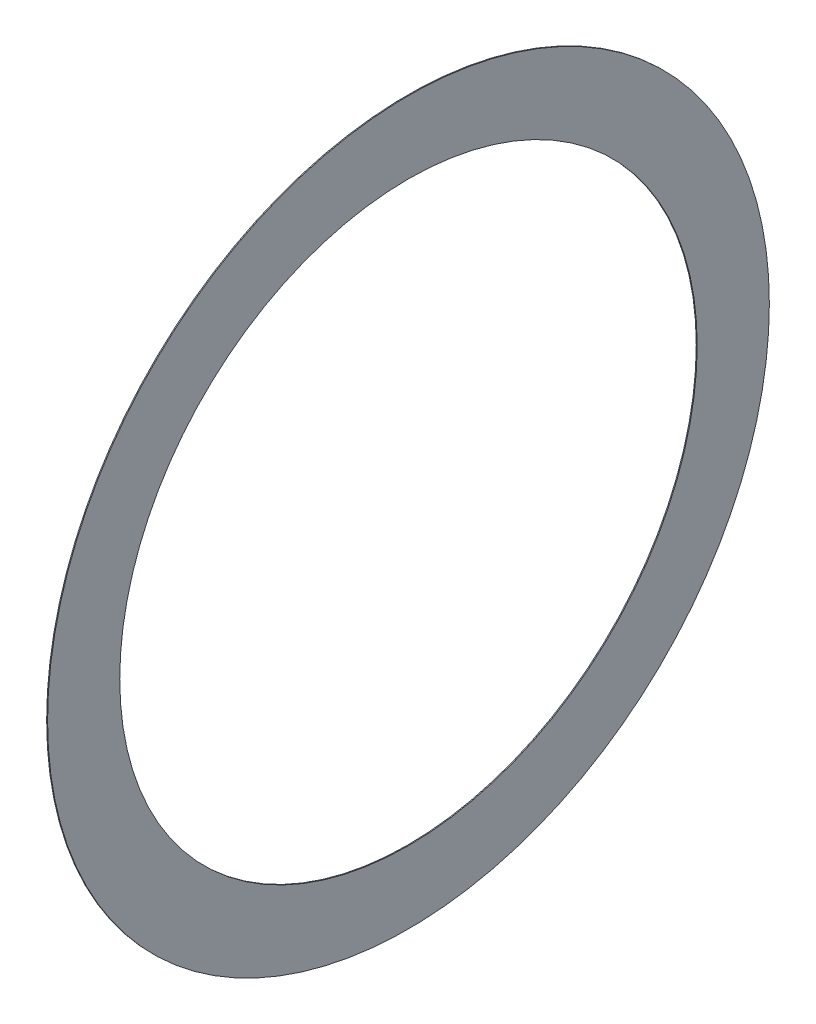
from build123d import *

# Parameters (mm, degrees)
ESQUISSE1_W = 0.25
ESQUISSE1_H = 19.5


with BuildPart() as part:
    # Esquisse1 → R_volution1 (revolve)
    with BuildSketch(Plane.XY, mode=Mode.PRIVATE) as r_volution1_sk:
        with Locations((0.125, 87.75)):
            Rectangle(ESQUISSE1_W, ESQUISSE1_H)
    revolve(r_volution1_sk.sketch.rotate(Axis((0, 0, 0), (1, 0, 0)), 90), axis=Axis((0, 0, 0), (1, 0, 0)))


solid = part.part
